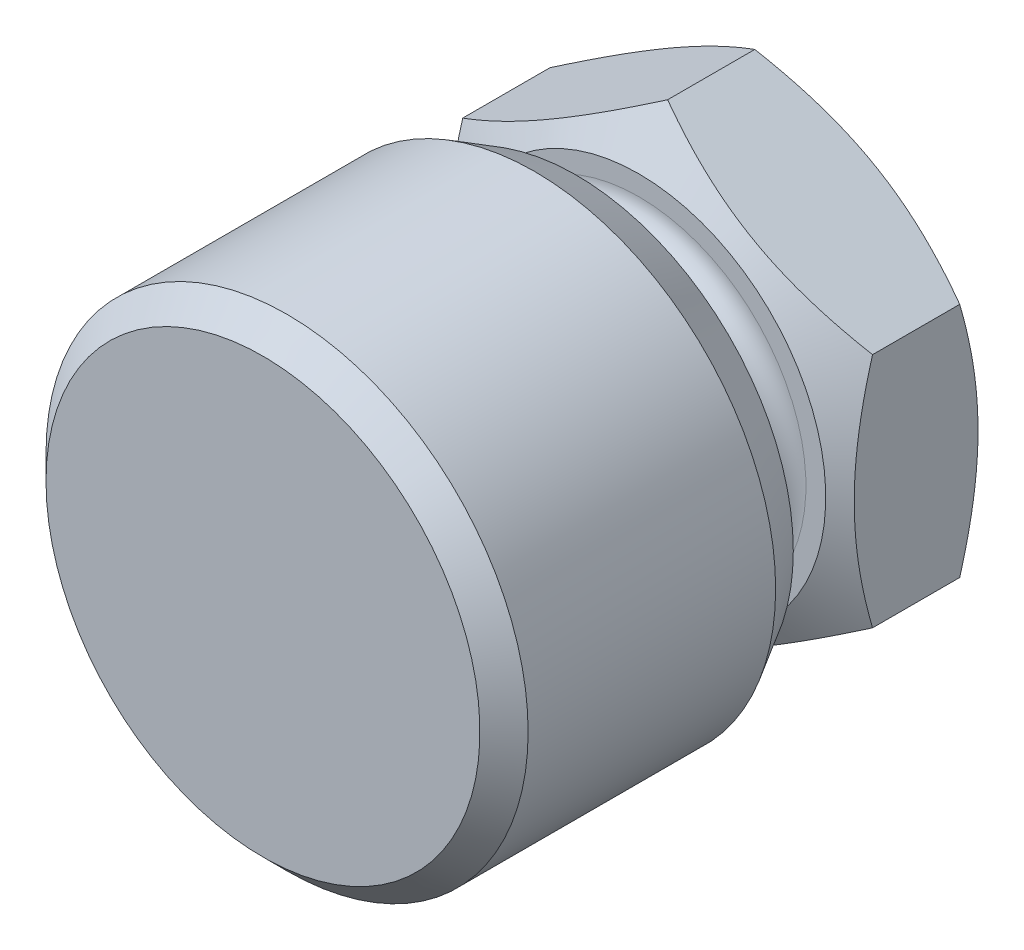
ISO-10303-21;
HEADER;
FILE_DESCRIPTION(('STEP AP214'),'2;1');
FILE_NAME('part.step','',(''),(''),'','','');
FILE_SCHEMA(('AUTOMOTIVE_DESIGN { 1 0 10303 214 1 1 1 1 }'));
ENDSEC;
DATA;
#1=APPLICATION_CONTEXT('core data for automotive mechanical design processes');
#2=APPLICATION_PROTOCOL_DEFINITION('international standard','automotive_design',2000,#1);
#3=PRODUCT_CONTEXT('',#1,'mechanical');
#4=PRODUCT('Part','Part','',(#3));
#5=PRODUCT_RELATED_PRODUCT_CATEGORY('part','',(#4));
#6=PRODUCT_DEFINITION_FORMATION('','',#4);
#7=PRODUCT_DEFINITION_CONTEXT('part definition',#1,'design');
#8=PRODUCT_DEFINITION('design','',#6,#7);
#9=PRODUCT_DEFINITION_SHAPE('','',#8);
#10=(LENGTH_UNIT() NAMED_UNIT(*) SI_UNIT(.MILLI.,.METRE.));
#11=(NAMED_UNIT(*) PLANE_ANGLE_UNIT() SI_UNIT($,.RADIAN.));
#12=(NAMED_UNIT(*) SI_UNIT($,.STERADIAN.) SOLID_ANGLE_UNIT());
#13=UNCERTAINTY_MEASURE_WITH_UNIT(LENGTH_MEASURE(1.E-05),#10,'distance_accuracy_value','');
#14=(GEOMETRIC_REPRESENTATION_CONTEXT(3) GLOBAL_UNCERTAINTY_ASSIGNED_CONTEXT((#13)) GLOBAL_UNIT_ASSIGNED_CONTEXT((#10,
#11,#12)) REPRESENTATION_CONTEXT('',''));
#15=CARTESIAN_POINT('',(0.,0.,0.));
#16=DIRECTION('',(0.,0.,1.));
#17=DIRECTION('',(1.,0.,0.));
#18=AXIS2_PLACEMENT_3D('',#15,#16,#17);
#19=CARTESIAN_POINT('',(0.,0.,21.5953521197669));
#20=DIRECTION('',(0.,0.,-1.));
#21=DIRECTION('',(-1.,0.,0.));
#22=AXIS2_PLACEMENT_3D('',#19,#20,#21);
#23=CONICAL_SURFACE('',#22,9.,0.785398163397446);
#24=CARTESIAN_POINT('',(0.,0.,20.5953521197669));
#25=DIRECTION('',(0.,0.,-1.));
#26=DIRECTION('',(-1.,0.,0.));
#27=AXIS2_PLACEMENT_3D('',#24,#25,#26);
#28=CIRCLE('',#27,10.);
#29=CARTESIAN_POINT('',(-10.,0.,20.5953521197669));
#30=VERTEX_POINT('',#29);
#31=EDGE_CURVE('E259',#30,#30,#28,.T.);
#32=ORIENTED_EDGE('',*,*,#31,.F.);
#33=EDGE_LOOP('',(#32));
#34=FACE_BOUND('',#33,.T.);
#35=CARTESIAN_POINT('',(0.,0.,21.5953521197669));
#36=DIRECTION('',(0.,0.,-1.));
#37=DIRECTION('',(-1.,0.,0.));
#38=AXIS2_PLACEMENT_3D('',#35,#36,#37);
#39=CIRCLE('',#38,9.);
#40=CARTESIAN_POINT('',(-9.,0.,21.5953521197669));
#41=VERTEX_POINT('',#40);
#42=EDGE_CURVE('E262',#41,#41,#39,.F.);
#43=ORIENTED_EDGE('',*,*,#42,.F.);
#44=EDGE_LOOP('',(#43));
#45=FACE_BOUND('',#44,.T.);
#46=ADVANCED_FACE('F14',(#34,#45),#23,.T.);
#47=CARTESIAN_POINT('',(0.,0.,21.5953521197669));
#48=DIRECTION('',(0.,0.,1.));
#49=DIRECTION('',(1.,0.,0.));
#50=AXIS2_PLACEMENT_3D('',#47,#48,#49);
#51=CYLINDRICAL_SURFACE('',#50,10.);
#52=ORIENTED_EDGE('',*,*,#31,.T.);
#53=EDGE_LOOP('',(#52));
#54=FACE_BOUND('',#53,.T.);
#55=CARTESIAN_POINT('',(0.,0.,10.3274029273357));
#56=DIRECTION('',(0.,0.,1.));
#57=DIRECTION('',(1.,0.,0.));
#58=AXIS2_PLACEMENT_3D('',#55,#56,#57);
#59=CIRCLE('',#58,10.);
#60=CARTESIAN_POINT('',(10.,0.,10.3274029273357));
#61=VERTEX_POINT('',#60);
#62=EDGE_CURVE('E269',#61,#61,#59,.T.);
#63=ORIENTED_EDGE('',*,*,#62,.T.);
#64=EDGE_LOOP('',(#63));
#65=FACE_BOUND('',#64,.T.);
#66=ADVANCED_FACE('F285',(#54,#65),#51,.T.);
#67=CARTESIAN_POINT('',(0.,0.,8.59535211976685));
#68=DIRECTION('',(0.,0.,1.));
#69=DIRECTION('',(1.,0.,0.));
#70=AXIS2_PLACEMENT_3D('',#67,#68,#69);
#71=CONICAL_SURFACE('',#70,9.,0.523598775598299);
#72=ORIENTED_EDGE('',*,*,#62,.F.);
#73=EDGE_LOOP('',(#72));
#74=FACE_BOUND('',#73,.T.);
#75=CARTESIAN_POINT('',(0.,0.,8.59535211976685));
#76=DIRECTION('',(0.,0.,1.));
#77=DIRECTION('',(1.,0.,0.));
#78=AXIS2_PLACEMENT_3D('',#75,#76,#77);
#79=CIRCLE('',#78,9.);
#80=CARTESIAN_POINT('',(9.,0.,8.59535211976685));
#81=VERTEX_POINT('',#80);
#82=EDGE_CURVE('E272',#81,#81,#79,.T.);
#83=ORIENTED_EDGE('',*,*,#82,.T.);
#84=EDGE_LOOP('',(#83));
#85=FACE_BOUND('',#84,.T.);
#86=ADVANCED_FACE('F290',(#74,#85),#71,.T.);
#87=CARTESIAN_POINT('',(-10.,0.,21.5953521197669));
#88=DIRECTION('',(0.,0.,-1.));
#89=DIRECTION('',(-1.,0.,0.));
#90=AXIS2_PLACEMENT_3D('',#87,#88,#89);
#91=PLANE('',#90);
#92=ORIENTED_EDGE('',*,*,#42,.T.);
#93=EDGE_LOOP('',(#92));
#94=FACE_BOUND('',#93,.T.);
#95=ADVANCED_FACE('F282',(#94),#91,.F.);
#96=CARTESIAN_POINT('',(-6.95,0.,8.59535211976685));
#97=DIRECTION('',(0.,0.,1.));
#98=DIRECTION('',(1.,0.,0.));
#99=AXIS2_PLACEMENT_3D('',#96,#97,#98);
#100=PLANE('',#99);
#101=ORIENTED_EDGE('',*,*,#82,.F.);
#102=EDGE_LOOP('',(#101));
#103=FACE_BOUND('',#102,.T.);
#104=CARTESIAN_POINT('',(0.,0.,8.59535211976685));
#105=DIRECTION('',(0.,0.,1.));
#106=DIRECTION('',(0.,-1.,0.));
#107=AXIS2_PLACEMENT_3D('',#104,#105,#106);
#108=CIRCLE('',#107,6.5740146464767);
#109=CARTESIAN_POINT('',(0.,-6.5740146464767,8.59535211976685));
#110=VERTEX_POINT('',#109);
#111=EDGE_CURVE('E9',#110,#110,#108,.T.);
#112=ORIENTED_EDGE('',*,*,#111,.T.);
#113=EDGE_LOOP('',(#112));
#114=FACE_BOUND('',#113,.T.);
#115=ADVANCED_FACE('F251',(#103,#114),#100,.F.);
#116=CARTESIAN_POINT('',(0.,0.,0.));
#117=DIRECTION('',(0.,0.,-1.));
#118=DIRECTION('',(0.,1.,0.));
#119=AXIS2_PLACEMENT_3D('',#116,#117,#118);
#120=CONICAL_SURFACE('',#119,5.85,0.785398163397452);
#121=CARTESIAN_POINT('',(0.,0.,0.84999999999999));
#122=DIRECTION('',(0.,0.,-1.));
#123=DIRECTION('',(0.,-1.,0.));
#124=AXIS2_PLACEMENT_3D('',#121,#122,#123);
#125=CIRCLE('',#124,5.);
#126=CARTESIAN_POINT('',(0.,-5.,0.84999999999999));
#127=VERTEX_POINT('',#126);
#128=EDGE_CURVE('E17',#127,#127,#125,.F.);
#129=ORIENTED_EDGE('',*,*,#128,.T.);
#130=EDGE_LOOP('',(#129));
#131=FACE_BOUND('',#130,.T.);
#132=CARTESIAN_POINT('',(0.,0.,0.));
#133=DIRECTION('',(0.,0.,-1.));
#134=DIRECTION('',(0.,1.,0.));
#135=AXIS2_PLACEMENT_3D('',#132,#133,#134);
#136=CIRCLE('',#135,5.85);
#137=CARTESIAN_POINT('',(0.,5.85,0.));
#138=VERTEX_POINT('',#137);
#139=EDGE_CURVE('E256',#138,#138,#136,.T.);
#140=ORIENTED_EDGE('',*,*,#139,.T.);
#141=EDGE_LOOP('',(#140));
#142=FACE_BOUND('',#141,.T.);
#143=ADVANCED_FACE('F244',(#131,#142),#120,.F.);
#144=CARTESIAN_POINT('',(0.,-9.81495457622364,0.));
#145=DIRECTION('',(0.,0.,1.));
#146=DIRECTION('',(0.,-1.,0.));
#147=AXIS2_PLACEMENT_3D('',#144,#145,#146);
#148=PLANE('',#147);
#149=ORIENTED_EDGE('',*,*,#139,.F.);
#150=EDGE_LOOP('',(#149));
#151=FACE_BOUND('',#150,.T.);
#152=CARTESIAN_POINT('',(0.,0.,0.));
#153=DIRECTION('',(0.,0.,-1.));
#154=DIRECTION('',(0.,1.,0.));
#155=AXIS2_PLACEMENT_3D('',#152,#153,#154);
#156=CIRCLE('',#155,7.75);
#157=CARTESIAN_POINT('',(0.,7.75,0.));
#158=VERTEX_POINT('',#157);
#159=EDGE_CURVE('E187',#158,#158,#156,.T.);
#160=ORIENTED_EDGE('',*,*,#159,.T.);
#161=EDGE_LOOP('',(#160));
#162=FACE_BOUND('',#161,.T.);
#163=ADVANCED_FACE('F242',(#151,#162),#148,.F.);
#164=CARTESIAN_POINT('',(0.,0.,0.));
#165=DIRECTION('',(0.,0.,1.));
#166=DIRECTION('',(0.,1.,0.));
#167=AXIS2_PLACEMENT_3D('',#164,#165,#166);
#168=CONICAL_SURFACE('',#167,7.75,1.0471975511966);
#169=ORIENTED_EDGE('',*,*,#159,.F.);
#170=EDGE_LOOP('',(#169));
#171=FACE_BOUND('',#170,.T.);
#172=CARTESIAN_POINT('',(-8.5,13.0674083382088,4.52566801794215));
#173=CARTESIAN_POINT('',(-8.5,12.6970264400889,4.34646393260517));
#174=CARTESIAN_POINT('',(-8.5,12.3257817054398,4.16901198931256));
#175=CARTESIAN_POINT('',(-8.5,11.5811070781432,3.81860050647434));
#176=CARTESIAN_POINT('',(-8.5,11.2076768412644,3.64564169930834));
#177=CARTESIAN_POINT('',(-8.5,10.4561928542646,3.30431011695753));
#178=CARTESIAN_POINT('',(-8.5,10.0781249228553,3.13596845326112));
#179=CARTESIAN_POINT('',(-8.5,9.31894068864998,2.80633194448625));
#180=CARTESIAN_POINT('',(-8.5,8.93782453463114,2.64503675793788));
#181=CARTESIAN_POINT('',(-8.5,8.16024781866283,2.32657055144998));
#182=CARTESIAN_POINT('',(-8.5,7.76367370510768,2.1696752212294));
#183=CARTESIAN_POINT('',(-8.5,6.96584516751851,1.86803908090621));
#184=CARTESIAN_POINT('',(-8.5,6.56459021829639,1.72329964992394));
#185=CARTESIAN_POINT('',(-8.5,5.75754493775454,1.44985865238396));
#186=CARTESIAN_POINT('',(-8.5,5.35176606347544,1.32112364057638));
#187=CARTESIAN_POINT('',(-8.5,4.53440542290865,1.08389490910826));
#188=CARTESIAN_POINT('',(-8.5,4.12282556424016,0.975394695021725));
#189=CARTESIAN_POINT('',(-8.5,3.2957373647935,0.784474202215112));
#190=CARTESIAN_POINT('',(-8.5,2.88026033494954,0.701921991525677));
#191=CARTESIAN_POINT('',(-8.5,2.25335567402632,0.601204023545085));
#192=CARTESIAN_POINT('',(-8.5,2.0437567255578,0.57148172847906));
#193=CARTESIAN_POINT('',(-8.5,1.62355650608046,0.520325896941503));
#194=CARTESIAN_POINT('',(-8.5,1.41295533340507,0.498891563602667));
#195=CARTESIAN_POINT('',(-8.5,0.993735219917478,0.465001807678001));
#196=CARTESIAN_POINT('',(-8.5,0.78512529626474,0.45243525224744));
#197=CARTESIAN_POINT('',(-8.5,0.367561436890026,0.436126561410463));
#198=CARTESIAN_POINT('',(-8.5,0.158607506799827,0.43238428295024));
#199=CARTESIAN_POINT('',(-8.5,-0.259274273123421,0.433813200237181));
#200=CARTESIAN_POINT('',(-8.5,-0.468202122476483,0.438984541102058));
#201=CARTESIAN_POINT('',(-8.5,-0.885657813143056,0.458116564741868));
#202=CARTESIAN_POINT('',(-8.5,-1.09418563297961,0.472077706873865));
#203=CARTESIAN_POINT('',(-8.5,-1.59874294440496,0.516201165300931));
#204=CARTESIAN_POINT('',(-8.5,-1.89439892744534,0.550722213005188));
#205=CARTESIAN_POINT('',(-8.5,-2.48342769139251,0.635524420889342));
#206=CARTESIAN_POINT('',(-8.5,-2.77680014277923,0.68580781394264));
#207=CARTESIAN_POINT('',(-8.5,-3.65319685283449,0.857627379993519));
#208=CARTESIAN_POINT('',(-8.5,-4.2321658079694,1.00009989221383));
#209=CARTESIAN_POINT('',(-8.5,-5.09799333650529,1.24609692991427));
#210=CARTESIAN_POINT('',(-8.5,-5.38936478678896,1.33464080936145));
#211=CARTESIAN_POINT('',(-8.5,-5.96927459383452,1.52064802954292));
#212=CARTESIAN_POINT('',(-8.5,-6.2578129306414,1.61811143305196));
#213=CARTESIAN_POINT('',(-8.5,-6.83215576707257,1.82041649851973));
#214=CARTESIAN_POINT('',(-8.5,-7.1179611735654,1.92525560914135));
#215=CARTESIAN_POINT('',(-8.5,-7.68721940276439,2.14110586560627));
#216=CARTESIAN_POINT('',(-8.5,-7.97067226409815,2.25211690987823));
#217=CARTESIAN_POINT('',(-8.5,-8.68625208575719,2.53990591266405));
#218=CARTESIAN_POINT('',(-8.5,-9.11697898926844,2.72016036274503));
#219=CARTESIAN_POINT('',(-8.5,-9.97446570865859,3.08989937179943));
#220=CARTESIAN_POINT('',(-8.5,-10.4012252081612,3.27938465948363));
#221=CARTESIAN_POINT('',(-8.5,-11.2516092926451,3.66555544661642));
#222=CARTESIAN_POINT('',(-8.5,-11.6752329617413,3.8622429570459));
#223=CARTESIAN_POINT('',(-8.5,-12.5198099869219,4.26122375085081));
#224=CARTESIAN_POINT('',(-8.5,-12.9407634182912,4.46351687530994));
#225=CARTESIAN_POINT('',(-8.5,-13.7810262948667,4.87283077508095));
#226=CARTESIAN_POINT('',(-8.5,-14.2003329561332,5.07985725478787));
#227=CARTESIAN_POINT('',(-8.5,-15.0371442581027,5.49752124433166));
#228=CARTESIAN_POINT('',(-8.5,-15.454648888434,5.70815877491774));
#229=CARTESIAN_POINT('',(-8.5,-16.2880900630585,6.13234427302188));
#230=CARTESIAN_POINT('',(-8.5,-16.704026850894,6.3458917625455));
#231=CARTESIAN_POINT('',(-8.5,-17.5346431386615,6.77541937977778));
#232=CARTESIAN_POINT('',(-8.5,-17.9493226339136,6.99139951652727));
#233=CARTESIAN_POINT('',(-8.5,-19.1138362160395,7.60153093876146));
#234=CARTESIAN_POINT('',(-8.5,-19.8624637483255,7.9979848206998));
#235=CARTESIAN_POINT('',(-8.5,-21.3571542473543,8.79576721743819));
#236=CARTESIAN_POINT('',(-8.5,-22.1032170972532,9.19709595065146));
#237=CARTESIAN_POINT('',(-8.5,-23.591297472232,10.002323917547));
#238=CARTESIAN_POINT('',(-8.5,-24.3333204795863,10.4062130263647));
#239=CARTESIAN_POINT('',(-8.5,-25.4451681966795,11.014160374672));
#240=CARTESIAN_POINT('',(-8.5,-25.815574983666,11.2171555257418));
#241=CARTESIAN_POINT('',(-8.5,-26.5560406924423,11.6237780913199));
#242=CARTESIAN_POINT('',(-8.5,-26.9260996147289,11.8274055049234));
#243=CARTESIAN_POINT('',(-8.5,-27.2960051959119,12.0313111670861));
#244=B_SPLINE_CURVE_WITH_KNOTS('',3,(#172,#173,#174,#175,#176,#177,#178,#179,#180,#181,#182,
#183,#184,#185,#186,#187,#188,#189,#190,#191,#192,#193,#194,#195,#196,#197,#198,#199,#200,#201,
#202,#203,#204,#205,#206,#207,#208,#209,#210,#211,#212,#213,#214,#215,#216,#217,#218,#219,#220,
#221,#222,#223,#224,#225,#226,#227,#228,#229,#230,#231,#232,#233,#234,#235,#236,#237,#238,#239,
#240,#241,#242,#243),.UNSPECIFIED.,.F.,.F.,(4,2,2,2,2,2,2,2,2,2,2,2,2,2,2,2,2,2,2,2,2,2,2,2,2,2,
2,2,2,2,2,2,2,2,2,4),(0.,1.23438662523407,2.46897320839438,3.71047455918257,4.95191568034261,
6.2312081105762,7.51064548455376,8.78736252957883,10.063669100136,11.3333772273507,
11.9683266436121,12.6032149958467,13.2299982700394,13.8567713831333,14.4835547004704,
15.1103707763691,16.002858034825,16.8954717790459,18.6817036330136,19.5952151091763,
20.5087330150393,21.421936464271,22.3351248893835,23.7357409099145,25.1364676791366,
26.5375885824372,27.9386698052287,29.3415392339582,30.7444167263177,32.1470664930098,
33.5497214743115,36.0910654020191,38.6325236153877,41.1669816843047,42.4341331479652,
43.7012827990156),.UNSPECIFIED.);
#245=CARTESIAN_POINT('',(-8.5,-4.90747728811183,1.19220208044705));
#246=VERTEX_POINT('',#245);
#247=CARTESIAN_POINT('',(-8.5,4.90747728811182,1.19220208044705));
#248=VERTEX_POINT('',#247);
#249=EDGE_CURVE('E67',#246,#248,#244,.F.);
#250=ORIENTED_EDGE('',*,*,#249,.T.);
#251=CARTESIAN_POINT('',(-8.5002,4.90736181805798,1.1922687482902));
#252=CARTESIAN_POINT('',(-8.31336077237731,5.01523349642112,1.12999884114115));
#253=CARTESIAN_POINT('',(-8.12582494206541,5.1235073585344,1.07055499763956));
#254=CARTESIAN_POINT('',(-7.74923024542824,5.34093440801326,0.958097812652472));
#255=CARTESIAN_POINT('',(-7.56017075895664,5.45008795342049,0.905087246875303));
#256=CARTESIAN_POINT('',(-6.9899652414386,5.77929626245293,0.756746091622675));
#257=CARTESIAN_POINT('',(-6.60656835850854,6.00065055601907,0.672371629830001));
#258=CARTESIAN_POINT('',(-6.03282233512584,6.33190297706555,0.573432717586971));
#259=CARTESIAN_POINT('',(-5.84418723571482,6.44081150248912,0.545247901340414));
#260=CARTESIAN_POINT('',(-5.46606397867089,6.65912106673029,0.497986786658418));
#261=CARTESIAN_POINT('',(-5.27657589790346,6.76852206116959,0.478909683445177));
#262=CARTESIAN_POINT('',(-4.8972734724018,6.98751241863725,0.450347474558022));
#263=CARTESIAN_POINT('',(-4.70745974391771,7.09710142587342,0.440851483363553));
#264=CARTESIAN_POINT('',(-4.32765694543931,7.3163806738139,0.431655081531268));
#265=CARTESIAN_POINT('',(-4.13766788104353,7.42607091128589,0.431954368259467));
#266=CARTESIAN_POINT('',(-3.78247698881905,7.63114046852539,0.441667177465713));
#267=CARTESIAN_POINT('',(-3.6172500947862,7.72653426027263,0.449895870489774));
#268=CARTESIAN_POINT('',(-3.28718328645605,7.9170984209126,0.473601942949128));
#269=CARTESIAN_POINT('',(-3.12234339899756,8.01226877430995,0.489079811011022));
#270=CARTESIAN_POINT('',(-2.62846189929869,8.29741139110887,0.546021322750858));
#271=CARTESIAN_POINT('',(-2.30029449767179,8.48687892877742,0.597985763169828));
#272=CARTESIAN_POINT('',(-1.64047857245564,8.86782383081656,0.727897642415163));
#273=CARTESIAN_POINT('',(-1.30891425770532,9.05925257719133,0.806395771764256));
#274=CARTESIAN_POINT('',(-0.650730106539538,9.43925537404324,0.984554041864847));
#275=CARTESIAN_POINT('',(-0.324101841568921,9.62783429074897,1.0841723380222));
#276=CARTESIAN_POINT('',(0.000199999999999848,9.81507004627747,1.1922687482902));
#277=B_SPLINE_CURVE_WITH_KNOTS('',3,(#251,#252,#253,#254,#255,#256,#257,#258,#259,#260,#261,
#262,#263,#264,#265,#266,#267,#268,#269,#270,#271,#272,#273,#274,#275,#276),.UNSPECIFIED.,.F.,
.F.,(4,2,2,2,2,2,2,2,2,2,2,2,4),(0.,0.673596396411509,1.34748239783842,2.69805431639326,
3.356799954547,4.01548737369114,4.67342558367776,5.33134346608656,5.9040955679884,
6.47688628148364,7.62328361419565,8.79510569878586,9.96462743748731),.UNSPECIFIED.);
#278=CARTESIAN_POINT('',(0.,9.81495457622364,1.19220208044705));
#279=VERTEX_POINT('',#278);
#280=EDGE_CURVE('E83',#248,#279,#277,.T.);
#281=ORIENTED_EDGE('',*,*,#280,.T.);
#282=CARTESIAN_POINT('',(-0.00019999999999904,9.81507004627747,1.1922687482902));
#283=CARTESIAN_POINT('',(0.186639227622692,9.70719836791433,1.12999884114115));
#284=CARTESIAN_POINT('',(0.374175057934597,9.59892450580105,1.07055499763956));
#285=CARTESIAN_POINT('',(0.750769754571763,9.3814974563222,0.95809781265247));
#286=CARTESIAN_POINT('',(0.939829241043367,9.27234391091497,0.905087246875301));
#287=CARTESIAN_POINT('',(1.5100347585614,8.94313560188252,0.756746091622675));
#288=CARTESIAN_POINT('',(1.89343164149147,8.72178130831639,0.672371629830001));
#289=CARTESIAN_POINT('',(2.46717766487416,8.39052888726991,0.57343271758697));
#290=CARTESIAN_POINT('',(2.65581276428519,8.28162036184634,0.545247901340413));
#291=CARTESIAN_POINT('',(3.03393602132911,8.06331079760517,0.497986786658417));
#292=CARTESIAN_POINT('',(3.22342410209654,7.95390980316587,0.478909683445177));
#293=CARTESIAN_POINT('',(3.6027265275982,7.73491944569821,0.450347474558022));
#294=CARTESIAN_POINT('',(3.79254025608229,7.62533043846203,0.440851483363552));
#295=CARTESIAN_POINT('',(4.17234305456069,7.40605119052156,0.431655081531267));
#296=CARTESIAN_POINT('',(4.36233211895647,7.29636095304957,0.431954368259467));
#297=CARTESIAN_POINT('',(4.71752301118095,7.09129139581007,0.441667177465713));
#298=CARTESIAN_POINT('',(4.8827499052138,6.99589760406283,0.449895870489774));
#299=CARTESIAN_POINT('',(5.21281671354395,6.80533344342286,0.473601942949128));
#300=CARTESIAN_POINT('',(5.37765660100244,6.71016309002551,0.489079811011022));
#301=CARTESIAN_POINT('',(5.87153810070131,6.42502047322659,0.546021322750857));
#302=CARTESIAN_POINT('',(6.19970550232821,6.23555293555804,0.597985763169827));
#303=CARTESIAN_POINT('',(6.85952142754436,5.8546080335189,0.727897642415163));
#304=CARTESIAN_POINT('',(7.19108574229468,5.66317928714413,0.806395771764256));
#305=CARTESIAN_POINT('',(7.84926989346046,5.28317649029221,0.984554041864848));
#306=CARTESIAN_POINT('',(8.17589815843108,5.09459757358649,1.0841723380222));
#307=CARTESIAN_POINT('',(8.5002,4.90736181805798,1.1922687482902));
#308=B_SPLINE_CURVE_WITH_KNOTS('',3,(#282,#283,#284,#285,#286,#287,#288,#289,#290,#291,#292,
#293,#294,#295,#296,#297,#298,#299,#300,#301,#302,#303,#304,#305,#306,#307),.UNSPECIFIED.,.F.,
.F.,(4,2,2,2,2,2,2,2,2,2,2,2,4),(0.,0.673596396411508,1.34748239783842,2.69805431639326,
3.356799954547,4.01548737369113,4.67342558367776,5.33134346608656,5.9040955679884,
6.47688628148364,7.62328361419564,8.79510569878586,9.96462743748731),.UNSPECIFIED.);
#309=CARTESIAN_POINT('',(8.5,4.90747728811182,1.19220208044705));
#310=VERTEX_POINT('',#309);
#311=EDGE_CURVE('E194',#279,#310,#308,.T.);
#312=ORIENTED_EDGE('',*,*,#311,.T.);
#313=CARTESIAN_POINT('',(8.5,13.0674083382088,4.5256680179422));
#314=CARTESIAN_POINT('',(8.5,12.6970264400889,4.34646393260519));
#315=CARTESIAN_POINT('',(8.5,12.3257817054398,4.16901198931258));
#316=CARTESIAN_POINT('',(8.5,11.5811070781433,3.81860050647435));
#317=CARTESIAN_POINT('',(8.5,11.2076768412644,3.64564169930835));
#318=CARTESIAN_POINT('',(8.5,10.4561928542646,3.30431011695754));
#319=CARTESIAN_POINT('',(8.5,10.0781249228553,3.13596845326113));
#320=CARTESIAN_POINT('',(8.5,9.31894068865,2.80633194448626));
#321=CARTESIAN_POINT('',(8.5,8.93782453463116,2.64503675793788));
#322=CARTESIAN_POINT('',(8.5,8.16024781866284,2.32657055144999));
#323=CARTESIAN_POINT('',(8.5,7.7636737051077,2.1696752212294));
#324=CARTESIAN_POINT('',(8.5,6.96584516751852,1.86803908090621));
#325=CARTESIAN_POINT('',(8.5,6.5645902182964,1.72329964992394));
#326=CARTESIAN_POINT('',(8.5,5.75754493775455,1.44985865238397));
#327=CARTESIAN_POINT('',(8.5,5.35176606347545,1.32112364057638));
#328=CARTESIAN_POINT('',(8.5,4.53440542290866,1.08389490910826));
#329=CARTESIAN_POINT('',(8.5,4.12282556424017,0.975394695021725));
#330=CARTESIAN_POINT('',(8.5,3.29573736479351,0.784474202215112));
#331=CARTESIAN_POINT('',(8.5,2.88026033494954,0.701921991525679));
#332=CARTESIAN_POINT('',(8.5,2.25335567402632,0.601204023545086));
#333=CARTESIAN_POINT('',(8.5,2.0437567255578,0.571481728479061));
#334=CARTESIAN_POINT('',(8.5,1.62355650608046,0.520325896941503));
#335=CARTESIAN_POINT('',(8.5,1.41295533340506,0.498891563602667));
#336=CARTESIAN_POINT('',(8.5,0.993735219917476,0.465001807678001));
#337=CARTESIAN_POINT('',(8.5,0.785125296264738,0.45243525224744));
#338=CARTESIAN_POINT('',(8.5,0.367561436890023,0.436126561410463));
#339=CARTESIAN_POINT('',(8.5,0.158607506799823,0.43238428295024));
#340=CARTESIAN_POINT('',(8.5,-0.259274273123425,0.433813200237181));
#341=CARTESIAN_POINT('',(8.5,-0.468202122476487,0.438984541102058));
#342=CARTESIAN_POINT('',(8.5,-0.885657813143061,0.458116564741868));
#343=CARTESIAN_POINT('',(8.5,-1.09418563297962,0.472077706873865));
#344=CARTESIAN_POINT('',(8.5,-1.59874294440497,0.516201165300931));
#345=CARTESIAN_POINT('',(8.5,-1.89439892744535,0.550722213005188));
#346=CARTESIAN_POINT('',(8.5,-2.48342769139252,0.635524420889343));
#347=CARTESIAN_POINT('',(8.5,-2.77680014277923,0.685807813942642));
#348=CARTESIAN_POINT('',(8.5,-3.6531968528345,0.857627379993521));
#349=CARTESIAN_POINT('',(8.5,-4.23216580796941,1.00009989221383));
#350=CARTESIAN_POINT('',(8.5,-5.09799333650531,1.24609692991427));
#351=CARTESIAN_POINT('',(8.5,-5.38936478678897,1.33464080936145));
#352=CARTESIAN_POINT('',(8.5,-5.96927459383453,1.52064802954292));
#353=CARTESIAN_POINT('',(8.5,-6.25781293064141,1.61811143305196));
#354=CARTESIAN_POINT('',(8.5,-6.83215576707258,1.82041649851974));
#355=CARTESIAN_POINT('',(8.5,-7.1179611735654,1.92525560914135));
#356=CARTESIAN_POINT('',(8.5,-7.6872194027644,2.14110586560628));
#357=CARTESIAN_POINT('',(8.5,-7.97067226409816,2.25211690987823));
#358=CARTESIAN_POINT('',(8.5,-8.6862520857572,2.53990591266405));
#359=CARTESIAN_POINT('',(8.5,-9.11697898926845,2.72016036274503));
#360=CARTESIAN_POINT('',(8.5,-9.9744657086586,3.08989937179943));
#361=CARTESIAN_POINT('',(8.5,-10.4012252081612,3.27938465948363));
#362=CARTESIAN_POINT('',(8.5,-11.2516092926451,3.66555544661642));
#363=CARTESIAN_POINT('',(8.5,-11.6752329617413,3.8622429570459));
#364=CARTESIAN_POINT('',(8.5,-12.5198099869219,4.26122375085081));
#365=CARTESIAN_POINT('',(8.5,-12.9407634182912,4.46351687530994));
#366=CARTESIAN_POINT('',(8.5,-13.7810262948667,4.87283077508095));
#367=CARTESIAN_POINT('',(8.5,-14.2003329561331,5.07985725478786));
#368=CARTESIAN_POINT('',(8.5,-15.0371442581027,5.49752124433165));
#369=CARTESIAN_POINT('',(8.5,-15.454648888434,5.70815877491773));
#370=CARTESIAN_POINT('',(8.5,-16.2880900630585,6.13234427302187));
#371=CARTESIAN_POINT('',(8.5,-16.704026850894,6.34589176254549));
#372=CARTESIAN_POINT('',(8.5,-17.5346431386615,6.77541937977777));
#373=CARTESIAN_POINT('',(8.5,-17.9493226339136,6.99139951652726));
#374=CARTESIAN_POINT('',(8.5,-19.1138362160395,7.60153093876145));
#375=CARTESIAN_POINT('',(8.5,-19.8624637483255,7.99798482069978));
#376=CARTESIAN_POINT('',(8.5,-21.3571542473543,8.79576721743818));
#377=CARTESIAN_POINT('',(8.5,-22.1032170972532,9.19709595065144));
#378=CARTESIAN_POINT('',(8.5,-23.5912974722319,10.002323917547));
#379=CARTESIAN_POINT('',(8.5,-24.3333204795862,10.4062130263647));
#380=CARTESIAN_POINT('',(8.5,-25.4451681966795,11.014160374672));
#381=CARTESIAN_POINT('',(8.5,-25.815574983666,11.2171555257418));
#382=CARTESIAN_POINT('',(8.5,-26.5560406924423,11.6237780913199));
#383=CARTESIAN_POINT('',(8.5,-26.9260996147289,11.8274055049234));
#384=CARTESIAN_POINT('',(8.5,-27.2960051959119,12.0313111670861));
#385=B_SPLINE_CURVE_WITH_KNOTS('',3,(#313,#314,#315,#316,#317,#318,#319,#320,#321,#322,#323,
#324,#325,#326,#327,#328,#329,#330,#331,#332,#333,#334,#335,#336,#337,#338,#339,#340,#341,#342,
#343,#344,#345,#346,#347,#348,#349,#350,#351,#352,#353,#354,#355,#356,#357,#358,#359,#360,#361,
#362,#363,#364,#365,#366,#367,#368,#369,#370,#371,#372,#373,#374,#375,#376,#377,#378,#379,#380,
#381,#382,#383,#384),.UNSPECIFIED.,.F.,.F.,(4,2,2,2,2,2,2,2,2,2,2,2,2,2,2,2,2,2,2,2,2,2,2,2,2,2,
2,2,2,2,2,2,2,2,2,4),(0.,1.23438662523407,2.46897320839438,3.71047455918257,4.95191568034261,
6.23120811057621,7.51064548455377,8.78736252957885,10.063669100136,11.3333772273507,
11.9683266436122,12.6032149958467,13.2299982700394,13.8567713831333,14.4835547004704,
15.1103707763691,16.002858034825,16.8954717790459,18.6817036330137,19.5952151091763,
20.5087330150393,21.421936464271,22.3351248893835,23.7357409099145,25.1364676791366,
26.5375885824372,27.9386698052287,29.3415392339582,30.7444167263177,32.1470664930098,
33.5497214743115,36.0910654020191,38.6325236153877,41.1669816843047,42.4341331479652,
43.7012827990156),.UNSPECIFIED.);
#386=CARTESIAN_POINT('',(8.5,-4.90747728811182,1.19220208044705));
#387=VERTEX_POINT('',#386);
#388=EDGE_CURVE('E186',#310,#387,#385,.T.);
#389=ORIENTED_EDGE('',*,*,#388,.T.);
#390=CARTESIAN_POINT('',(8.5002,-4.90736181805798,1.1922687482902));
#391=CARTESIAN_POINT('',(8.31336077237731,-5.01523349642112,1.12999884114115));
#392=CARTESIAN_POINT('',(8.12582494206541,-5.1235073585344,1.07055499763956));
#393=CARTESIAN_POINT('',(7.74923024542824,-5.34093440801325,0.95809781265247));
#394=CARTESIAN_POINT('',(7.56017075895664,-5.45008795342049,0.905087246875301));
#395=CARTESIAN_POINT('',(6.9899652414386,-5.77929626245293,0.756746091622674));
#396=CARTESIAN_POINT('',(6.60656835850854,-6.00065055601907,0.67237162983));
#397=CARTESIAN_POINT('',(6.03282233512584,-6.33190297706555,0.573432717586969));
#398=CARTESIAN_POINT('',(5.84418723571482,-6.44081150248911,0.545247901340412));
#399=CARTESIAN_POINT('',(5.46606397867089,-6.65912106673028,0.497986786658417));
#400=CARTESIAN_POINT('',(5.27657589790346,-6.76852206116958,0.478909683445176));
#401=CARTESIAN_POINT('',(4.8972734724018,-6.98751241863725,0.450347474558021));
#402=CARTESIAN_POINT('',(4.70745974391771,-7.09710142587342,0.440851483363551));
#403=CARTESIAN_POINT('',(4.32765694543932,-7.3163806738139,0.431655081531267));
#404=CARTESIAN_POINT('',(4.13766788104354,-7.42607091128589,0.431954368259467));
#405=CARTESIAN_POINT('',(3.78247698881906,-7.63114046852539,0.441667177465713));
#406=CARTESIAN_POINT('',(3.6172500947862,-7.72653426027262,0.449895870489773));
#407=CARTESIAN_POINT('',(3.28718328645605,-7.9170984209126,0.473601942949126));
#408=CARTESIAN_POINT('',(3.12234339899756,-8.01226877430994,0.489079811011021));
#409=CARTESIAN_POINT('',(2.62846189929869,-8.29741139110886,0.546021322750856));
#410=CARTESIAN_POINT('',(2.30029449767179,-8.48687892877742,0.597985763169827));
#411=CARTESIAN_POINT('',(1.64047857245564,-8.86782383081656,0.727897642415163));
#412=CARTESIAN_POINT('',(1.30891425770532,-9.05925257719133,0.806395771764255));
#413=CARTESIAN_POINT('',(0.650730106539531,-9.43925537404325,0.984554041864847));
#414=CARTESIAN_POINT('',(0.324101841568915,-9.62783429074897,1.0841723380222));
#415=CARTESIAN_POINT('',(-0.000200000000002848,-9.81507004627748,1.1922687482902));
#416=B_SPLINE_CURVE_WITH_KNOTS('',3,(#390,#391,#392,#393,#394,#395,#396,#397,#398,#399,#400,
#401,#402,#403,#404,#405,#406,#407,#408,#409,#410,#411,#412,#413,#414,#415),.UNSPECIFIED.,.F.,
.F.,(4,2,2,2,2,2,2,2,2,2,2,2,4),(0.,0.673596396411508,1.34748239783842,2.69805431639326,
3.356799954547,4.01548737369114,4.67342558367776,5.33134346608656,5.9040955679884,
6.47688628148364,7.62328361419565,8.79510569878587,9.96462743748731),.UNSPECIFIED.);
#417=CARTESIAN_POINT('',(0.,-9.81495457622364,1.19220208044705));
#418=VERTEX_POINT('',#417);
#419=EDGE_CURVE('E30',#387,#418,#416,.T.);
#420=ORIENTED_EDGE('',*,*,#419,.T.);
#421=CARTESIAN_POINT('',(0.000199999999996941,-9.81507004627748,1.1922687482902));
#422=CARTESIAN_POINT('',(-0.186639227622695,-9.70719836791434,1.12999884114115));
#423=CARTESIAN_POINT('',(-0.374175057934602,-9.59892450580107,1.07055499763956));
#424=CARTESIAN_POINT('',(-0.750769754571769,-9.38149745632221,0.958097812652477));
#425=CARTESIAN_POINT('',(-0.939829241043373,-9.27234391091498,0.905087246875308));
#426=CARTESIAN_POINT('',(-1.5100347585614,-8.94313560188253,0.756746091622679));
#427=CARTESIAN_POINT('',(-1.89343164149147,-8.7217813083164,0.672371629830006));
#428=CARTESIAN_POINT('',(-2.46717766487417,-8.39052888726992,0.573432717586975));
#429=CARTESIAN_POINT('',(-2.65581276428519,-8.28162036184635,0.545247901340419));
#430=CARTESIAN_POINT('',(-3.03393602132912,-8.06331079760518,0.497986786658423));
#431=CARTESIAN_POINT('',(-3.22342410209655,-7.95390980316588,0.478909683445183));
#432=CARTESIAN_POINT('',(-3.60272652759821,-7.73491944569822,0.450347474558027));
#433=CARTESIAN_POINT('',(-3.7925402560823,-7.62533043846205,0.440851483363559));
#434=CARTESIAN_POINT('',(-4.17234305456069,-7.40605119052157,0.431655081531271));
#435=CARTESIAN_POINT('',(-4.36233211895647,-7.29636095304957,0.431954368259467));
#436=CARTESIAN_POINT('',(-4.71752301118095,-7.09129139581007,0.441667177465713));
#437=CARTESIAN_POINT('',(-4.8827499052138,-6.99589760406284,0.449895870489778));
#438=CARTESIAN_POINT('',(-5.21281671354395,-6.80533344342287,0.473601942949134));
#439=CARTESIAN_POINT('',(-5.37765660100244,-6.71016309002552,0.489079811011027));
#440=CARTESIAN_POINT('',(-5.87153810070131,-6.4250204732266,0.546021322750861));
#441=CARTESIAN_POINT('',(-6.19970550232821,-6.23555293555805,0.597985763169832));
#442=CARTESIAN_POINT('',(-6.85952142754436,-5.85460803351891,0.727897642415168));
#443=CARTESIAN_POINT('',(-7.19108574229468,-5.66317928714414,0.806395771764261));
#444=CARTESIAN_POINT('',(-7.84926989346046,-5.28317649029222,0.98455404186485));
#445=CARTESIAN_POINT('',(-8.17589815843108,-5.0945975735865,1.0841723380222));
#446=CARTESIAN_POINT('',(-8.5002,-4.90736181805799,1.1922687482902));
#447=B_SPLINE_CURVE_WITH_KNOTS('',3,(#421,#422,#423,#424,#425,#426,#427,#428,#429,#430,#431,
#432,#433,#434,#435,#436,#437,#438,#439,#440,#441,#442,#443,#444,#445,#446),.UNSPECIFIED.,.F.,
.F.,(4,2,2,2,2,2,2,2,2,2,2,2,4),(0.,0.673596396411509,1.34748239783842,2.69805431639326,
3.356799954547,4.01548737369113,4.67342558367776,5.33134346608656,5.90409556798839,
6.47688628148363,7.62328361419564,8.79510569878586,9.9646274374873),.UNSPECIFIED.);
#448=EDGE_CURVE('E22',#418,#246,#447,.T.);
#449=ORIENTED_EDGE('',*,*,#448,.T.);
#450=EDGE_LOOP('',(#250,#281,#312,#389,#420,#449));
#451=FACE_BOUND('',#450,.T.);
#452=ADVANCED_FACE('F66',(#171,#451),#168,.T.);
#453=CARTESIAN_POINT('',(0.,0.,11.));
#454=DIRECTION('',(0.,0.,-1.));
#455=DIRECTION('',(0.,-1.,0.));
#456=AXIS2_PLACEMENT_3D('',#453,#454,#455);
#457=SPHERICAL_SURFACE('',#456,7.);
#458=CARTESIAN_POINT('',(0.,0.,7.5));
#459=DIRECTION('',(0.,0.,1.));
#460=DIRECTION('',(0.,-1.,0.));
#461=AXIS2_PLACEMENT_3D('',#458,#459,#460);
#462=CIRCLE('',#461,6.06217782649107);
#463=CARTESIAN_POINT('',(0.,-6.06217782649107,7.5));
#464=VERTEX_POINT('',#463);
#465=EDGE_CURVE('E114',#464,#464,#462,.T.);
#466=CARTESIAN_POINT('',(0.,-6.06217782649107,7.5));
#467=CARTESIAN_POINT('',(0.,-6.06848275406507,7.51092045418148));
#468=CARTESIAN_POINT('',(0.,-6.07475817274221,7.52185794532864));
#469=CARTESIAN_POINT('',(0.,-6.08724981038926,7.5437666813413));
#470=CARTESIAN_POINT('',(0.,-6.09346602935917,7.55473792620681));
#471=CARTESIAN_POINT('',(0.,-6.10583908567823,7.57671384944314));
#472=CARTESIAN_POINT('',(0.,-6.11199592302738,7.58771852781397));
#473=CARTESIAN_POINT('',(0.,-6.12425003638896,7.60976099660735));
#474=CARTESIAN_POINT('',(0.,-6.13034731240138,7.6207987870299));
#475=CARTESIAN_POINT('',(0.,-6.1424821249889,7.64290715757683));
#476=CARTESIAN_POINT('',(0.,-6.14851966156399,7.65397773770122));
#477=CARTESIAN_POINT('',(0.,-6.16053481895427,7.67615136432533));
#478=CARTESIAN_POINT('',(0.,-6.16651243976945,7.68725441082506));
#479=CARTESIAN_POINT('',(0.,-6.17840759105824,7.70949264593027));
#480=CARTESIAN_POINT('',(0.,-6.18432512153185,7.72062783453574));
#481=CARTESIAN_POINT('',(0.,-6.19609991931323,7.74293002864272));
#482=CARTESIAN_POINT('',(0.,-6.201957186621,7.75409703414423));
#483=CARTESIAN_POINT('',(0.,-6.21361128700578,7.77646253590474));
#484=CARTESIAN_POINT('',(0.,-6.2194081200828,7.78766103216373));
#485=CARTESIAN_POINT('',(0.,-6.23094118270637,7.81008918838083));
#486=CARTESIAN_POINT('',(0.,-6.23667741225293,7.82131884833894));
#487=CARTESIAN_POINT('',(0.,-6.24808910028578,7.84380900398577));
#488=CARTESIAN_POINT('',(0.,-6.25376455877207,7.8550694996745));
#489=CARTESIAN_POINT('',(0.,-6.26505453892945,7.8776209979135));
#490=CARTESIAN_POINT('',(0.,-6.27066906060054,7.88891200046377));
#491=CARTESIAN_POINT('',(0.,-6.28183700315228,7.91152418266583));
#492=CARTESIAN_POINT('',(0.,-6.28739042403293,7.92284536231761));
#493=CARTESIAN_POINT('',(0.,-6.29843600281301,7.94551756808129));
#494=CARTESIAN_POINT('',(0.,-6.30392816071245,7.95686859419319));
#495=CARTESIAN_POINT('',(0.,-6.31485105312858,7.97960016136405));
#496=CARTESIAN_POINT('',(0.,-6.32028178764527,7.99098070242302));
#497=CARTESIAN_POINT('',(0.,-6.33108167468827,8.01377096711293));
#498=CARTESIAN_POINT('',(0.,-6.33645082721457,8.02518069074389));
#499=CARTESIAN_POINT('',(0.,-6.34712739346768,8.04802898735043));
#500=CARTESIAN_POINT('',(0.,-6.3524348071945,8.05946756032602));
#501=CARTESIAN_POINT('',(0.,-6.36298774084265,8.08237322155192));
#502=CARTESIAN_POINT('',(0.,-6.36823326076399,8.09384030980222));
#503=CARTESIAN_POINT('',(0.,-6.37866225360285,8.11680266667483));
#504=CARTESIAN_POINT('',(0.,-6.38384572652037,8.12829793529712));
#505=CARTESIAN_POINT('',(0.,-6.39415047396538,8.15131631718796));
#506=CARTESIAN_POINT('',(0.,-6.39927174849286,8.16283943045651));
#507=CARTESIAN_POINT('',(0.,-6.40945194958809,8.18591316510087));
#508=CARTESIAN_POINT('',(0.,-6.41451087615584,8.19746378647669));
#509=CARTESIAN_POINT('',(0.,-6.42456623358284,8.22059219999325));
#510=CARTESIAN_POINT('',(0.,-6.42956266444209,8.23216999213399));
#511=CARTESIAN_POINT('',(0.,-6.43949288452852,8.25535240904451));
#512=CARTESIAN_POINT('',(0.,-6.4444266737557,8.26695703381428));
#513=CARTESIAN_POINT('',(0.,-6.45423146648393,8.29019277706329));
#514=CARTESIAN_POINT('',(0.,-6.45910246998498,8.30182389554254));
#515=CARTESIAN_POINT('',(0.,-6.46878154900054,8.32511228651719));
#516=CARTESIAN_POINT('',(0.,-6.47358962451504,8.33676955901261));
#517=CARTESIAN_POINT('',(0.,-6.48314270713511,8.36010991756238));
#518=CARTESIAN_POINT('',(0.,-6.48788771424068,8.37179300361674));
#519=CARTESIAN_POINT('',(0.,-6.49731452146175,8.39518464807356));
#520=CARTESIAN_POINT('',(0.,-6.50199632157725,8.40689320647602));
#521=CARTESIAN_POINT('',(0.,-6.51129657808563,8.43033545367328));
#522=CARTESIAN_POINT('',(0.,-6.5159150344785,8.44206914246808));
#523=CARTESIAN_POINT('',(0.,-6.52508846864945,8.4655613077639));
#524=CARTESIAN_POINT('',(0.,-6.52964344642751,8.47731978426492));
#525=CARTESIAN_POINT('',(0.,-6.53868979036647,8.50086118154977));
#526=CARTESIAN_POINT('',(0.,-6.54318115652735,8.51264410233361));
#527=CARTESIAN_POINT('',(0.,-6.55210014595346,8.53623404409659));
#528=CARTESIAN_POINT('',(0.,-6.55652776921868,8.54804106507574));
#529=CARTESIAN_POINT('',(0.,-6.56531914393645,8.57167886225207));
#530=CARTESIAN_POINT('',(0.,-6.569682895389,8.58350963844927));
#531=CARTESIAN_POINT('',(0.,-6.5740146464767,8.59535211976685));
#532=B_SPLINE_CURVE_WITH_KNOTS('',3,(#466,#467,#468,#469,#470,#471,#472,#473,#474,#475,#476,
#477,#478,#479,#480,#481,#482,#483,#484,#485,#486,#487,#488,#489,#490,#491,#492,#493,#494,#495,
#496,#497,#498,#499,#500,#501,#502,#503,#504,#505,#506,#507,#508,#509,#510,#511,#512,#513,#514,
#515,#516,#517,#518,#519,#520,#521,#522,#523,#524,#525,#526,#527,#528,#529,#530,#531),
.UNSPECIFIED.,.F.,.F.,(4,2,2,2,2,2,2,2,2,2,2,2,2,2,2,2,2,2,2,2,2,2,2,2,2,2,2,2,2,2,2,2,4),(0.,
0.0378295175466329,0.075659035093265,0.113488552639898,0.151318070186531,0.189147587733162,
0.226977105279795,0.264806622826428,0.30263614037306,0.340465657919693,0.378295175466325,
0.416124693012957,0.45395421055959,0.491783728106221,0.529613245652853,0.567442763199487,
0.605272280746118,0.643101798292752,0.680931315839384,0.718760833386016,0.756590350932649,
0.79441986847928,0.832249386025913,0.870078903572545,0.907908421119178,0.945737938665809,
0.983567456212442,1.02139697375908,1.05922649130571,1.09705600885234,1.13488552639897,
1.1727150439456,1.21054456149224),.UNSPECIFIED.);
#533=EDGE_CURVE('BSEAM138',#464,#110,#532,.T.);
#534=ORIENTED_EDGE('',*,*,#465,.T.);
#535=ORIENTED_EDGE('',*,*,#111,.F.);
#536=ORIENTED_EDGE('',*,*,#533,.T.);
#537=ORIENTED_EDGE('',*,*,#533,.F.);
#538=EDGE_LOOP('',(#534,#536,#535,#537));
#539=FACE_BOUND('',#538,.T.);
#540=ADVANCED_FACE('F138',(#539),#457,.T.);
#541=CARTESIAN_POINT('',(0.,0.,7.));
#542=DIRECTION('',(0.,0.,1.));
#543=DIRECTION('',(0.,-1.,0.));
#544=AXIS2_PLACEMENT_3D('',#541,#542,#543);
#545=TOROIDAL_SURFACE('',#544,6.92820323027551,1.);
#546=ORIENTED_EDGE('',*,*,#465,.F.);
#547=EDGE_LOOP('',(#546));
#548=FACE_BOUND('',#547,.T.);
#549=CARTESIAN_POINT('',(0.,0.,6.));
#550=DIRECTION('',(0.,0.,1.));
#551=DIRECTION('',(0.,-1.,0.));
#552=AXIS2_PLACEMENT_3D('',#549,#550,#551);
#553=CIRCLE('',#552,6.92820323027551);
#554=CARTESIAN_POINT('',(0.,-6.92820323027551,6.));
#555=VERTEX_POINT('',#554);
#556=EDGE_CURVE('E111',#555,#555,#553,.F.);
#557=ORIENTED_EDGE('',*,*,#556,.F.);
#558=EDGE_LOOP('',(#557));
#559=FACE_BOUND('',#558,.T.);
#560=ADVANCED_FACE('F236',(#548,#559),#545,.F.);
#561=CARTESIAN_POINT('',(0.,-9.81495457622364,6.));
#562=DIRECTION('',(0.,0.,1.));
#563=DIRECTION('',(0.,-1.,0.));
#564=AXIS2_PLACEMENT_3D('',#561,#562,#563);
#565=PLANE('',#564);
#566=ORIENTED_EDGE('',*,*,#556,.T.);
#567=EDGE_LOOP('',(#566));
#568=FACE_BOUND('',#567,.T.);
#569=CARTESIAN_POINT('',(0.,0.,6.));
#570=DIRECTION('',(0.,0.,1.));
#571=DIRECTION('',(0.,-1.,0.));
#572=AXIS2_PLACEMENT_3D('',#569,#570,#571);
#573=CIRCLE('',#572,7.75);
#574=CARTESIAN_POINT('',(0.,-7.75,6.));
#575=VERTEX_POINT('',#574);
#576=EDGE_CURVE('E82',#575,#575,#573,.T.);
#577=ORIENTED_EDGE('',*,*,#576,.T.);
#578=EDGE_LOOP('',(#577));
#579=FACE_BOUND('',#578,.T.);
#580=ADVANCED_FACE('F134',(#568,#579),#565,.T.);
#581=CARTESIAN_POINT('',(0.,0.,6.));
#582=DIRECTION('',(0.,0.,-1.));
#583=DIRECTION('',(0.,-1.,0.));
#584=AXIS2_PLACEMENT_3D('',#581,#582,#583);
#585=CONICAL_SURFACE('',#584,7.75,1.0471975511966);
#586=ORIENTED_EDGE('',*,*,#576,.F.);
#587=EDGE_LOOP('',(#586));
#588=FACE_BOUND('',#587,.T.);
#589=CARTESIAN_POINT('',(-8.5002,-4.90736181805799,4.8077312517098));
#590=CARTESIAN_POINT('',(-8.31336077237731,-5.01523349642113,4.87000115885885));
#591=CARTESIAN_POINT('',(-8.1258249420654,-5.12350735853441,4.92944500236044));
#592=CARTESIAN_POINT('',(-7.74923024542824,-5.34093440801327,5.04190218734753));
#593=CARTESIAN_POINT('',(-7.56017075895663,-5.4500879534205,5.09491275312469));
#594=CARTESIAN_POINT('',(-6.9899652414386,-5.77929626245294,5.24325390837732));
#595=CARTESIAN_POINT('',(-6.60656835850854,-6.00065055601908,5.32762837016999));
#596=CARTESIAN_POINT('',(-6.03282233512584,-6.33190297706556,5.42656728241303));
#597=CARTESIAN_POINT('',(-5.84418723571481,-6.44081150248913,5.45475209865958));
#598=CARTESIAN_POINT('',(-5.46606397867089,-6.6591210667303,5.50201321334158));
#599=CARTESIAN_POINT('',(-5.27657589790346,-6.7685220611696,5.52109031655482));
#600=CARTESIAN_POINT('',(-4.8972734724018,-6.98751241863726,5.54965252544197));
#601=CARTESIAN_POINT('',(-4.70745974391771,-7.09710142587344,5.55914851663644));
#602=CARTESIAN_POINT('',(-4.32765694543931,-7.31638067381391,5.56834491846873));
#603=CARTESIAN_POINT('',(-4.13766788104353,-7.4260709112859,5.56804563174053));
#604=CARTESIAN_POINT('',(-3.78247698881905,-7.6311404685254,5.55833282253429));
#605=CARTESIAN_POINT('',(-3.6172500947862,-7.72653426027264,5.55010412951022));
#606=CARTESIAN_POINT('',(-3.28718328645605,-7.91709842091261,5.52639805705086));
#607=CARTESIAN_POINT('',(-3.12234339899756,-8.01226877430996,5.51092018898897));
#608=CARTESIAN_POINT('',(-2.62846189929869,-8.29741139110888,5.45397867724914));
#609=CARTESIAN_POINT('',(-2.30029449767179,-8.48687892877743,5.40201423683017));
#610=CARTESIAN_POINT('',(-1.64047857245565,-8.86782383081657,5.27210235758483));
#611=CARTESIAN_POINT('',(-1.30891425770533,-9.05925257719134,5.19360422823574));
#612=CARTESIAN_POINT('',(-0.650730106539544,-9.43925537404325,5.01544595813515));
#613=CARTESIAN_POINT('',(-0.324101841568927,-9.62783429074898,4.9158276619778));
#614=CARTESIAN_POINT('',(0.000199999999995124,-9.81507004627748,4.8077312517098));
#615=B_SPLINE_CURVE_WITH_KNOTS('',3,(#589,#590,#591,#592,#593,#594,#595,#596,#597,#598,#599,
#600,#601,#602,#603,#604,#605,#606,#607,#608,#609,#610,#611,#612,#613,#614),.UNSPECIFIED.,.F.,
.F.,(4,2,2,2,2,2,2,2,2,2,2,2,4),(0.,0.673596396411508,1.34748239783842,2.69805431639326,
3.356799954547,4.01548737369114,4.67342558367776,5.33134346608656,5.9040955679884,
6.47688628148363,7.62328361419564,8.79510569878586,9.9646274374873),.UNSPECIFIED.);
#616=CARTESIAN_POINT('',(-8.5,-4.90747728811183,4.80779791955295));
#617=VERTEX_POINT('',#616);
#618=CARTESIAN_POINT('',(0.,-9.81495457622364,4.80779791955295));
#619=VERTEX_POINT('',#618);
#620=EDGE_CURVE('E87',#617,#619,#615,.T.);
#621=ORIENTED_EDGE('',*,*,#620,.T.);
#622=CARTESIAN_POINT('',(-0.000200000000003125,-9.81507004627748,4.8077312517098));
#623=CARTESIAN_POINT('',(0.186639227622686,-9.70719836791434,4.87000115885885));
#624=CARTESIAN_POINT('',(0.374175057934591,-9.59892450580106,4.92944500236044));
#625=CARTESIAN_POINT('',(0.750769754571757,-9.3814974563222,5.04190218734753));
#626=CARTESIAN_POINT('',(0.939829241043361,-9.27234391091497,5.0949127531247));
#627=CARTESIAN_POINT('',(1.51003475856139,-8.94313560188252,5.24325390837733));
#628=CARTESIAN_POINT('',(1.89343164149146,-8.72178130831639,5.32762837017));
#629=CARTESIAN_POINT('',(2.46717766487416,-8.39052888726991,5.42656728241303));
#630=CARTESIAN_POINT('',(2.65581276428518,-8.28162036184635,5.45475209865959));
#631=CARTESIAN_POINT('',(3.03393602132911,-8.06331079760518,5.50201321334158));
#632=CARTESIAN_POINT('',(3.22342410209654,-7.95390980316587,5.52109031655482));
#633=CARTESIAN_POINT('',(3.6027265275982,-7.73491944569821,5.54965252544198));
#634=CARTESIAN_POINT('',(3.79254025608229,-7.62533043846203,5.55914851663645));
#635=CARTESIAN_POINT('',(4.17234305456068,-7.40605119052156,5.56834491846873));
#636=CARTESIAN_POINT('',(4.36233211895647,-7.29636095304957,5.56804563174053));
#637=CARTESIAN_POINT('',(4.71752301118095,-7.09129139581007,5.55833282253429));
#638=CARTESIAN_POINT('',(4.8827499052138,-6.99589760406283,5.55010412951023));
#639=CARTESIAN_POINT('',(5.21281671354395,-6.80533344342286,5.52639805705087));
#640=CARTESIAN_POINT('',(5.37765660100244,-6.71016309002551,5.51092018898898));
#641=CARTESIAN_POINT('',(5.87153810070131,-6.42502047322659,5.45397867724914));
#642=CARTESIAN_POINT('',(6.19970550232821,-6.23555293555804,5.40201423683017));
#643=CARTESIAN_POINT('',(6.85952142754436,-5.8546080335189,5.27210235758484));
#644=CARTESIAN_POINT('',(7.19108574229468,-5.66317928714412,5.19360422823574));
#645=CARTESIAN_POINT('',(7.84926989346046,-5.28317649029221,5.01544595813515));
#646=CARTESIAN_POINT('',(8.17589815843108,-5.09459757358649,4.9158276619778));
#647=CARTESIAN_POINT('',(8.5002,-4.90736181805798,4.8077312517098));
#648=B_SPLINE_CURVE_WITH_KNOTS('',3,(#622,#623,#624,#625,#626,#627,#628,#629,#630,#631,#632,
#633,#634,#635,#636,#637,#638,#639,#640,#641,#642,#643,#644,#645,#646,#647),.UNSPECIFIED.,.F.,
.F.,(4,2,2,2,2,2,2,2,2,2,2,2,4),(0.,0.67359639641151,1.34748239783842,2.69805431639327,
3.356799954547,4.01548737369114,4.67342558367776,5.33134346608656,5.9040955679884,
6.47688628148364,7.62328361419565,8.79510569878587,9.96462743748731),.UNSPECIFIED.);
#649=CARTESIAN_POINT('',(8.5,-4.90747728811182,4.80779791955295));
#650=VERTEX_POINT('',#649);
#651=EDGE_CURVE('E91',#619,#650,#648,.T.);
#652=ORIENTED_EDGE('',*,*,#651,.T.);
#653=CARTESIAN_POINT('',(8.5,13.0674083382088,1.4743319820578));
#654=CARTESIAN_POINT('',(8.5,12.6970264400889,1.65353606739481));
#655=CARTESIAN_POINT('',(8.5,12.3257817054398,1.83098801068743));
#656=CARTESIAN_POINT('',(8.5,11.5811070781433,2.18139949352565));
#657=CARTESIAN_POINT('',(8.5,11.2076768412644,2.35435830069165));
#658=CARTESIAN_POINT('',(8.5,10.4561928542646,2.69568988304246));
#659=CARTESIAN_POINT('',(8.5,10.0781249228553,2.86403154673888));
#660=CARTESIAN_POINT('',(8.5,9.31894068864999,3.19366805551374));
#661=CARTESIAN_POINT('',(8.5,8.93782453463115,3.35496324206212));
#662=CARTESIAN_POINT('',(8.5,8.16024781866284,3.67342944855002));
#663=CARTESIAN_POINT('',(8.5,7.76367370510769,3.8303247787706));
#664=CARTESIAN_POINT('',(8.5,6.96584516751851,4.13196091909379));
#665=CARTESIAN_POINT('',(8.5,6.5645902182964,4.27670035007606));
#666=CARTESIAN_POINT('',(8.5,5.75754493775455,4.55014134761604));
#667=CARTESIAN_POINT('',(8.5,5.35176606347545,4.67887635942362));
#668=CARTESIAN_POINT('',(8.5,4.53440542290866,4.91610509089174));
#669=CARTESIAN_POINT('',(8.5,4.12282556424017,5.02460530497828));
#670=CARTESIAN_POINT('',(8.5,3.29573736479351,5.21552579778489));
#671=CARTESIAN_POINT('',(8.5,2.88026033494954,5.29807800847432));
#672=CARTESIAN_POINT('',(8.5,2.25335567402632,5.39879597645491));
#673=CARTESIAN_POINT('',(8.5,2.0437567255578,5.42851827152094));
#674=CARTESIAN_POINT('',(8.5,1.62355650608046,5.4796741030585));
#675=CARTESIAN_POINT('',(8.5,1.41295533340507,5.50110843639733));
#676=CARTESIAN_POINT('',(8.5,0.993735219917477,5.534998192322));
#677=CARTESIAN_POINT('',(8.5,0.785125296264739,5.54756474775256));
#678=CARTESIAN_POINT('',(8.5,0.367561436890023,5.56387343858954));
#679=CARTESIAN_POINT('',(8.5,0.158607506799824,5.56761571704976));
#680=CARTESIAN_POINT('',(8.5,-0.259274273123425,5.56618679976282));
#681=CARTESIAN_POINT('',(8.5,-0.468202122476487,5.56101545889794));
#682=CARTESIAN_POINT('',(8.5,-0.885657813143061,5.54188343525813));
#683=CARTESIAN_POINT('',(8.5,-1.09418563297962,5.52792229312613));
#684=CARTESIAN_POINT('',(8.5,-1.59874294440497,5.48379883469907));
#685=CARTESIAN_POINT('',(8.5,-1.89439892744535,5.44927778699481));
#686=CARTESIAN_POINT('',(8.5,-2.48342769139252,5.36447557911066));
#687=CARTESIAN_POINT('',(8.5,-2.77680014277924,5.31419218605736));
#688=CARTESIAN_POINT('',(8.5,-3.6531968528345,5.14237262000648));
#689=CARTESIAN_POINT('',(8.5,-4.23216580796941,4.99990010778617));
#690=CARTESIAN_POINT('',(8.5,-5.09799333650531,4.75390307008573));
#691=CARTESIAN_POINT('',(8.5,-5.38936478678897,4.66535919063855));
#692=CARTESIAN_POINT('',(8.5,-5.96927459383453,4.47935197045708));
#693=CARTESIAN_POINT('',(8.5,-6.25781293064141,4.38188856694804));
#694=CARTESIAN_POINT('',(8.5,-6.83215576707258,4.17958350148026));
#695=CARTESIAN_POINT('',(8.5,-7.1179611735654,4.07474439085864));
#696=CARTESIAN_POINT('',(8.5,-7.6872194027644,3.85889413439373));
#697=CARTESIAN_POINT('',(8.5,-7.97067226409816,3.74788309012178));
#698=CARTESIAN_POINT('',(8.5,-8.6862520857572,3.46009408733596));
#699=CARTESIAN_POINT('',(8.5,-9.11697898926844,3.27983963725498));
#700=CARTESIAN_POINT('',(8.5,-9.97446570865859,2.91010062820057));
#701=CARTESIAN_POINT('',(8.5,-10.4012252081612,2.72061534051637));
#702=CARTESIAN_POINT('',(8.5,-11.2516092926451,2.33444455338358));
#703=CARTESIAN_POINT('',(8.5,-11.6752329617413,2.1377570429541));
#704=CARTESIAN_POINT('',(8.5,-12.5198099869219,1.73877624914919));
#705=CARTESIAN_POINT('',(8.5,-12.9407634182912,1.53648312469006));
#706=CARTESIAN_POINT('',(8.5,-13.7810262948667,1.12716922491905));
#707=CARTESIAN_POINT('',(8.5,-14.2003329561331,0.920142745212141));
#708=CARTESIAN_POINT('',(8.5,-15.0371442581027,0.502478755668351));
#709=CARTESIAN_POINT('',(8.5,-15.454648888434,0.291841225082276));
#710=CARTESIAN_POINT('',(8.5,-16.2880900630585,-0.132344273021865));
#711=CARTESIAN_POINT('',(8.5,-16.704026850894,-0.345891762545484));
#712=CARTESIAN_POINT('',(8.5,-17.5346431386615,-0.775419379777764));
#713=CARTESIAN_POINT('',(8.5,-17.9493226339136,-0.991399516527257));
#714=CARTESIAN_POINT('',(8.5,-19.1138362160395,-1.60153093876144));
#715=CARTESIAN_POINT('',(8.5,-19.8624637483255,-1.99798482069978));
#716=CARTESIAN_POINT('',(8.5,-21.3571542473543,-2.79576721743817));
#717=CARTESIAN_POINT('',(8.5,-22.1032170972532,-3.19709595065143));
#718=CARTESIAN_POINT('',(8.5,-23.5912974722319,-4.00232391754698));
#719=CARTESIAN_POINT('',(8.5,-24.3333204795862,-4.4062130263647));
#720=CARTESIAN_POINT('',(8.5,-25.4451681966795,-5.01416037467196));
#721=CARTESIAN_POINT('',(8.5,-25.815574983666,-5.2171555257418));
#722=CARTESIAN_POINT('',(8.5,-26.5560406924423,-5.62377809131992));
#723=CARTESIAN_POINT('',(8.5,-26.9260996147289,-5.82740550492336));
#724=CARTESIAN_POINT('',(8.5,-27.2960051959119,-6.0313111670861));
#725=B_SPLINE_CURVE_WITH_KNOTS('',3,(#653,#654,#655,#656,#657,#658,#659,#660,#661,#662,#663,
#664,#665,#666,#667,#668,#669,#670,#671,#672,#673,#674,#675,#676,#677,#678,#679,#680,#681,#682,
#683,#684,#685,#686,#687,#688,#689,#690,#691,#692,#693,#694,#695,#696,#697,#698,#699,#700,#701,
#702,#703,#704,#705,#706,#707,#708,#709,#710,#711,#712,#713,#714,#715,#716,#717,#718,#719,#720,
#721,#722,#723,#724),.UNSPECIFIED.,.F.,.F.,(4,2,2,2,2,2,2,2,2,2,2,2,2,2,2,2,2,2,2,2,2,2,2,2,2,2,
2,2,2,2,2,2,2,2,2,4),(0.,1.23438662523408,2.46897320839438,3.71047455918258,4.95191568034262,
6.23120811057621,7.51064548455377,8.78736252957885,10.063669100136,11.3333772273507,
11.9683266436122,12.6032149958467,13.2299982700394,13.8567713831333,14.4835547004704,
15.1103707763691,16.002858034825,16.8954717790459,18.6817036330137,19.5952151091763,
20.5087330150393,21.421936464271,22.3351248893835,23.7357409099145,25.1364676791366,
26.5375885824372,27.9386698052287,29.3415392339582,30.7444167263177,32.1470664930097,
33.5497214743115,36.091065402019,38.6325236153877,41.1669816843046,42.4341331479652,
43.7012827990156),.UNSPECIFIED.);
#726=CARTESIAN_POINT('',(8.5,4.90747728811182,4.80779791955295));
#727=VERTEX_POINT('',#726);
#728=EDGE_CURVE('E159',#650,#727,#725,.F.);
#729=ORIENTED_EDGE('',*,*,#728,.T.);
#730=CARTESIAN_POINT('',(8.5002,4.90736181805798,4.8077312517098));
#731=CARTESIAN_POINT('',(8.31336077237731,5.01523349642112,4.87000115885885));
#732=CARTESIAN_POINT('',(8.12582494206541,5.1235073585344,4.92944500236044));
#733=CARTESIAN_POINT('',(7.74923024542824,5.34093440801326,5.04190218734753));
#734=CARTESIAN_POINT('',(7.56017075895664,5.45008795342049,5.0949127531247));
#735=CARTESIAN_POINT('',(6.9899652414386,5.77929626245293,5.24325390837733));
#736=CARTESIAN_POINT('',(6.60656835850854,6.00065055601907,5.32762837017));
#737=CARTESIAN_POINT('',(6.03282233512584,6.33190297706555,5.42656728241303));
#738=CARTESIAN_POINT('',(5.84418723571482,6.44081150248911,5.45475209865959));
#739=CARTESIAN_POINT('',(5.46606397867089,6.65912106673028,5.50201321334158));
#740=CARTESIAN_POINT('',(5.27657589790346,6.76852206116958,5.52109031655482));
#741=CARTESIAN_POINT('',(4.8972734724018,6.98751241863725,5.54965252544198));
#742=CARTESIAN_POINT('',(4.70745974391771,7.09710142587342,5.55914851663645));
#743=CARTESIAN_POINT('',(4.32765694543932,7.31638067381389,5.56834491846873));
#744=CARTESIAN_POINT('',(4.13766788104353,7.42607091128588,5.56804563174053));
#745=CARTESIAN_POINT('',(3.78247698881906,7.63114046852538,5.55833282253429));
#746=CARTESIAN_POINT('',(3.61725009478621,7.72653426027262,5.55010412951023));
#747=CARTESIAN_POINT('',(3.28718328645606,7.9170984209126,5.52639805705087));
#748=CARTESIAN_POINT('',(3.12234339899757,8.01226877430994,5.51092018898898));
#749=CARTESIAN_POINT('',(2.6284618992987,8.29741139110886,5.45397867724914));
#750=CARTESIAN_POINT('',(2.30029449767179,8.48687892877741,5.40201423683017));
#751=CARTESIAN_POINT('',(1.64047857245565,8.86782383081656,5.27210235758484));
#752=CARTESIAN_POINT('',(1.30891425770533,9.05925257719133,5.19360422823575));
#753=CARTESIAN_POINT('',(0.650730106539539,9.43925537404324,5.01544595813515));
#754=CARTESIAN_POINT('',(0.324101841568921,9.62783429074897,4.9158276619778));
#755=CARTESIAN_POINT('',(-0.000199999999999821,9.81507004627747,4.8077312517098));
#756=B_SPLINE_CURVE_WITH_KNOTS('',3,(#730,#731,#732,#733,#734,#735,#736,#737,#738,#739,#740,
#741,#742,#743,#744,#745,#746,#747,#748,#749,#750,#751,#752,#753,#754,#755),.UNSPECIFIED.,.F.,
.F.,(4,2,2,2,2,2,2,2,2,2,2,2,4),(0.,0.673596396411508,1.34748239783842,2.69805431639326,
3.356799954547,4.01548737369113,4.67342558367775,5.33134346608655,5.90409556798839,
6.47688628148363,7.62328361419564,8.79510569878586,9.96462743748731),.UNSPECIFIED.);
#757=CARTESIAN_POINT('',(0.,9.81495457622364,4.80779791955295));
#758=VERTEX_POINT('',#757);
#759=EDGE_CURVE('E152',#727,#758,#756,.T.);
#760=ORIENTED_EDGE('',*,*,#759,.T.);
#761=CARTESIAN_POINT('',(0.000200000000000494,9.81507004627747,4.8077312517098));
#762=CARTESIAN_POINT('',(-0.186639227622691,9.70719836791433,4.87000115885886));
#763=CARTESIAN_POINT('',(-0.374175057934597,9.59892450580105,4.92944500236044));
#764=CARTESIAN_POINT('',(-0.750769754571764,9.3814974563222,5.04190218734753));
#765=CARTESIAN_POINT('',(-0.939829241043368,9.27234391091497,5.0949127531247));
#766=CARTESIAN_POINT('',(-1.5100347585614,8.94313560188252,5.24325390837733));
#767=CARTESIAN_POINT('',(-1.89343164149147,8.72178130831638,5.32762837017));
#768=CARTESIAN_POINT('',(-2.46717766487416,8.39052888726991,5.42656728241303));
#769=CARTESIAN_POINT('',(-2.65581276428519,8.28162036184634,5.45475209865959));
#770=CARTESIAN_POINT('',(-3.03393602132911,8.06331079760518,5.50201321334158));
#771=CARTESIAN_POINT('',(-3.22342410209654,7.95390980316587,5.52109031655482));
#772=CARTESIAN_POINT('',(-3.6027265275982,7.73491944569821,5.54965252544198));
#773=CARTESIAN_POINT('',(-3.79254025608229,7.62533043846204,5.55914851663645));
#774=CARTESIAN_POINT('',(-4.17234305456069,7.40605119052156,5.56834491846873));
#775=CARTESIAN_POINT('',(-4.36233211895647,7.29636095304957,5.56804563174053));
#776=CARTESIAN_POINT('',(-4.71752301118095,7.09129139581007,5.55833282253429));
#777=CARTESIAN_POINT('',(-4.8827499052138,6.99589760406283,5.55010412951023));
#778=CARTESIAN_POINT('',(-5.21281671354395,6.80533344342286,5.52639805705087));
#779=CARTESIAN_POINT('',(-5.37765660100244,6.71016309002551,5.51092018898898));
#780=CARTESIAN_POINT('',(-5.87153810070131,6.42502047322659,5.45397867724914));
#781=CARTESIAN_POINT('',(-6.19970550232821,6.23555293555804,5.40201423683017));
#782=CARTESIAN_POINT('',(-6.85952142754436,5.8546080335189,5.27210235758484));
#783=CARTESIAN_POINT('',(-7.19108574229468,5.66317928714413,5.19360422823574));
#784=CARTESIAN_POINT('',(-7.84926989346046,5.28317649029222,5.01544595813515));
#785=CARTESIAN_POINT('',(-8.17589815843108,5.09459757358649,4.9158276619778));
#786=CARTESIAN_POINT('',(-8.5002,4.90736181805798,4.8077312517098));
#787=B_SPLINE_CURVE_WITH_KNOTS('',3,(#761,#762,#763,#764,#765,#766,#767,#768,#769,#770,#771,
#772,#773,#774,#775,#776,#777,#778,#779,#780,#781,#782,#783,#784,#785,#786),.UNSPECIFIED.,.F.,
.F.,(4,2,2,2,2,2,2,2,2,2,2,2,4),(0.,0.673596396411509,1.34748239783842,2.69805431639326,
3.356799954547,4.01548737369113,4.67342558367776,5.33134346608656,5.9040955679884,
6.47688628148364,7.62328361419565,8.79510569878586,9.96462743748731),.UNSPECIFIED.);
#788=CARTESIAN_POINT('',(-8.5,4.90747728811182,4.80779791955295));
#789=VERTEX_POINT('',#788);
#790=EDGE_CURVE('E38',#758,#789,#787,.T.);
#791=ORIENTED_EDGE('',*,*,#790,.T.);
#792=CARTESIAN_POINT('',(-8.5,13.0674083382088,1.47433198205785));
#793=CARTESIAN_POINT('',(-8.5,12.6970264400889,1.65353606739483));
#794=CARTESIAN_POINT('',(-8.5,12.3257817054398,1.83098801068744));
#795=CARTESIAN_POINT('',(-8.5,11.5811070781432,2.18139949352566));
#796=CARTESIAN_POINT('',(-8.5,11.2076768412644,2.35435830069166));
#797=CARTESIAN_POINT('',(-8.5,10.4561928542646,2.69568988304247));
#798=CARTESIAN_POINT('',(-8.5,10.0781249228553,2.86403154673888));
#799=CARTESIAN_POINT('',(-8.5,9.31894068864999,3.19366805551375));
#800=CARTESIAN_POINT('',(-8.5,8.93782453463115,3.35496324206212));
#801=CARTESIAN_POINT('',(-8.5,8.16024781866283,3.67342944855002));
#802=CARTESIAN_POINT('',(-8.5,7.76367370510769,3.8303247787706));
#803=CARTESIAN_POINT('',(-8.5,6.96584516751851,4.13196091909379));
#804=CARTESIAN_POINT('',(-8.5,6.56459021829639,4.27670035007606));
#805=CARTESIAN_POINT('',(-8.5,5.75754493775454,4.55014134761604));
#806=CARTESIAN_POINT('',(-8.5,5.35176606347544,4.67887635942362));
#807=CARTESIAN_POINT('',(-8.5,4.53440542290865,4.91610509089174));
#808=CARTESIAN_POINT('',(-8.5,4.12282556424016,5.02460530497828));
#809=CARTESIAN_POINT('',(-8.5,3.2957373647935,5.21552579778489));
#810=CARTESIAN_POINT('',(-8.5,2.88026033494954,5.29807800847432));
#811=CARTESIAN_POINT('',(-8.5,2.25335567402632,5.39879597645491));
#812=CARTESIAN_POINT('',(-8.5,2.0437567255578,5.42851827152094));
#813=CARTESIAN_POINT('',(-8.5,1.62355650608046,5.4796741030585));
#814=CARTESIAN_POINT('',(-8.5,1.41295533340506,5.50110843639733));
#815=CARTESIAN_POINT('',(-8.5,0.993735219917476,5.534998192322));
#816=CARTESIAN_POINT('',(-8.5,0.785125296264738,5.54756474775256));
#817=CARTESIAN_POINT('',(-8.5,0.367561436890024,5.56387343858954));
#818=CARTESIAN_POINT('',(-8.5,0.158607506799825,5.56761571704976));
#819=CARTESIAN_POINT('',(-8.5,-0.259274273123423,5.56618679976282));
#820=CARTESIAN_POINT('',(-8.5,-0.468202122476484,5.56101545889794));
#821=CARTESIAN_POINT('',(-8.5,-0.885657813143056,5.54188343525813));
#822=CARTESIAN_POINT('',(-8.5,-1.09418563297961,5.52792229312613));
#823=CARTESIAN_POINT('',(-8.5,-1.59874294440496,5.48379883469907));
#824=CARTESIAN_POINT('',(-8.5,-1.89439892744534,5.44927778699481));
#825=CARTESIAN_POINT('',(-8.5,-2.48342769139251,5.36447557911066));
#826=CARTESIAN_POINT('',(-8.5,-2.77680014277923,5.31419218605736));
#827=CARTESIAN_POINT('',(-8.5,-3.65319685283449,5.14237262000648));
#828=CARTESIAN_POINT('',(-8.5,-4.2321658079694,4.99990010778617));
#829=CARTESIAN_POINT('',(-8.5,-5.09799333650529,4.75390307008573));
#830=CARTESIAN_POINT('',(-8.5,-5.38936478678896,4.66535919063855));
#831=CARTESIAN_POINT('',(-8.5,-5.96927459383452,4.47935197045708));
#832=CARTESIAN_POINT('',(-8.5,-6.25781293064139,4.38188856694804));
#833=CARTESIAN_POINT('',(-8.5,-6.83215576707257,4.17958350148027));
#834=CARTESIAN_POINT('',(-8.5,-7.11796117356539,4.07474439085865));
#835=CARTESIAN_POINT('',(-8.5,-7.68721940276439,3.85889413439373));
#836=CARTESIAN_POINT('',(-8.5,-7.97067226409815,3.74788309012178));
#837=CARTESIAN_POINT('',(-8.5,-8.68625208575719,3.46009408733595));
#838=CARTESIAN_POINT('',(-8.5,-9.11697898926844,3.27983963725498));
#839=CARTESIAN_POINT('',(-8.5,-9.97446570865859,2.91010062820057));
#840=CARTESIAN_POINT('',(-8.5,-10.4012252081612,2.72061534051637));
#841=CARTESIAN_POINT('',(-8.5,-11.2516092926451,2.33444455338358));
#842=CARTESIAN_POINT('',(-8.5,-11.6752329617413,2.1377570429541));
#843=CARTESIAN_POINT('',(-8.5,-12.5198099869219,1.73877624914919));
#844=CARTESIAN_POINT('',(-8.5,-12.9407634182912,1.53648312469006));
#845=CARTESIAN_POINT('',(-8.5,-13.7810262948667,1.12716922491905));
#846=CARTESIAN_POINT('',(-8.5,-14.2003329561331,0.920142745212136));
#847=CARTESIAN_POINT('',(-8.5,-15.0371442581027,0.502478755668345));
#848=CARTESIAN_POINT('',(-8.5,-15.454648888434,0.291841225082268));
#849=CARTESIAN_POINT('',(-8.5,-16.2880900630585,-0.132344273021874));
#850=CARTESIAN_POINT('',(-8.5,-16.704026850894,-0.345891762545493));
#851=CARTESIAN_POINT('',(-8.5,-17.5346431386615,-0.775419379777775));
#852=CARTESIAN_POINT('',(-8.5,-17.9493226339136,-0.99139951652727));
#853=CARTESIAN_POINT('',(-8.5,-19.1138362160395,-1.60153093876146));
#854=CARTESIAN_POINT('',(-8.5,-19.8624637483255,-1.99798482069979));
#855=CARTESIAN_POINT('',(-8.5,-21.3571542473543,-2.79576721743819));
#856=CARTESIAN_POINT('',(-8.5,-22.1032170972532,-3.19709595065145));
#857=CARTESIAN_POINT('',(-8.5,-23.591297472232,-4.002323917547));
#858=CARTESIAN_POINT('',(-8.5,-24.3333204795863,-4.40621302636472));
#859=CARTESIAN_POINT('',(-8.5,-25.4451681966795,-5.01416037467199));
#860=CARTESIAN_POINT('',(-8.5,-25.815574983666,-5.21715552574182));
#861=CARTESIAN_POINT('',(-8.5,-26.5560406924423,-5.62377809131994));
#862=CARTESIAN_POINT('',(-8.5,-26.9260996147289,-5.82740550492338));
#863=CARTESIAN_POINT('',(-8.5,-27.2960051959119,-6.0313111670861));
#864=B_SPLINE_CURVE_WITH_KNOTS('',3,(#792,#793,#794,#795,#796,#797,#798,#799,#800,#801,#802,
#803,#804,#805,#806,#807,#808,#809,#810,#811,#812,#813,#814,#815,#816,#817,#818,#819,#820,#821,
#822,#823,#824,#825,#826,#827,#828,#829,#830,#831,#832,#833,#834,#835,#836,#837,#838,#839,#840,
#841,#842,#843,#844,#845,#846,#847,#848,#849,#850,#851,#852,#853,#854,#855,#856,#857,#858,#859,
#860,#861,#862,#863),.UNSPECIFIED.,.F.,.F.,(4,2,2,2,2,2,2,2,2,2,2,2,2,2,2,2,2,2,2,2,2,2,2,2,2,2,
2,2,2,2,2,2,2,2,2,4),(0.,1.23438662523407,2.46897320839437,3.71047455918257,4.9519156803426,
6.2312081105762,7.51064548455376,8.78736252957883,10.063669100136,11.3333772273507,
11.9683266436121,12.6032149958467,13.2299982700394,13.8567713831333,14.4835547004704,
15.1103707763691,16.002858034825,16.8954717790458,18.6817036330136,19.5952151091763,
20.5087330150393,21.421936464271,22.3351248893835,23.7357409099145,25.1364676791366,
26.5375885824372,27.9386698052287,29.3415392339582,30.7444167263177,32.1470664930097,
33.5497214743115,36.091065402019,38.6325236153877,41.1669816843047,42.4341331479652,
43.7012827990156),.UNSPECIFIED.);
#865=EDGE_CURVE('E73',#789,#617,#864,.T.);
#866=ORIENTED_EDGE('',*,*,#865,.T.);
#867=EDGE_LOOP('',(#621,#652,#729,#760,#791,#866));
#868=FACE_BOUND('',#867,.T.);
#869=ADVANCED_FACE('F130',(#588,#868),#585,.T.);
#870=CARTESIAN_POINT('',(-8.5,-4.90747728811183,6.));
#871=DIRECTION('',(0.5,0.866025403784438,0.));
#872=DIRECTION('',(-0.866025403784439,0.5,0.));
#873=AXIS2_PLACEMENT_3D('',#870,#871,#872);
#874=PLANE('',#873);
#875=ORIENTED_EDGE('',*,*,#448,.F.);
#876=DIRECTION('',(0.,0.,-1.));
#877=VECTOR('',#876,1.);
#878=CARTESIAN_POINT('',(0.,-9.81495457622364,6.));
#879=LINE('',#878,#877);
#880=EDGE_CURVE('E109',#619,#418,#879,.T.);
#881=ORIENTED_EDGE('',*,*,#880,.F.);
#882=ORIENTED_EDGE('',*,*,#620,.F.);
#883=DIRECTION('',(0.,0.,-1.));
#884=VECTOR('',#883,1.);
#885=CARTESIAN_POINT('',(-8.5,-4.90747728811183,6.));
#886=LINE('',#885,#884);
#887=EDGE_CURVE('E79',#617,#246,#886,.T.);
#888=ORIENTED_EDGE('',*,*,#887,.T.);
#889=EDGE_LOOP('',(#875,#881,#882,#888));
#890=FACE_BOUND('',#889,.T.);
#891=ADVANCED_FACE('F86',(#890),#874,.F.);
#892=CARTESIAN_POINT('',(0.,-9.81495457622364,6.));
#893=DIRECTION('',(-0.5,0.866025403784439,0.));
#894=DIRECTION('',(-0.866025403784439,-0.5,0.));
#895=AXIS2_PLACEMENT_3D('',#892,#893,#894);
#896=PLANE('',#895);
#897=ORIENTED_EDGE('',*,*,#419,.F.);
#898=DIRECTION('',(0.,0.,-1.));
#899=VECTOR('',#898,1.);
#900=CARTESIAN_POINT('',(8.5,-4.90747728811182,6.));
#901=LINE('',#900,#899);
#902=EDGE_CURVE('E106',#650,#387,#901,.T.);
#903=ORIENTED_EDGE('',*,*,#902,.F.);
#904=ORIENTED_EDGE('',*,*,#651,.F.);
#905=ORIENTED_EDGE('',*,*,#880,.T.);
#906=EDGE_LOOP('',(#897,#903,#904,#905));
#907=FACE_BOUND('',#906,.T.);
#908=ADVANCED_FACE('F170',(#907),#896,.F.);
#909=CARTESIAN_POINT('',(8.5,-4.90747728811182,6.));
#910=DIRECTION('',(-1.,0.,0.));
#911=DIRECTION('',(0.,0.,-1.));
#912=AXIS2_PLACEMENT_3D('',#909,#910,#911);
#913=PLANE('',#912);
#914=ORIENTED_EDGE('',*,*,#388,.F.);
#915=DIRECTION('',(0.,0.,-1.));
#916=VECTOR('',#915,1.);
#917=CARTESIAN_POINT('',(8.5,4.90747728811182,6.));
#918=LINE('',#917,#916);
#919=EDGE_CURVE('E103',#727,#310,#918,.T.);
#920=ORIENTED_EDGE('',*,*,#919,.F.);
#921=ORIENTED_EDGE('',*,*,#728,.F.);
#922=ORIENTED_EDGE('',*,*,#902,.T.);
#923=EDGE_LOOP('',(#914,#920,#921,#922));
#924=FACE_BOUND('',#923,.T.);
#925=ADVANCED_FACE('F173',(#924),#913,.F.);
#926=CARTESIAN_POINT('',(8.5,4.90747728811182,6.));
#927=DIRECTION('',(-0.5,-0.866025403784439,0.));
#928=DIRECTION('',(0.866025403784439,-0.5,0.));
#929=AXIS2_PLACEMENT_3D('',#926,#927,#928);
#930=PLANE('',#929);
#931=ORIENTED_EDGE('',*,*,#311,.F.);
#932=DIRECTION('',(0.,0.,-1.));
#933=VECTOR('',#932,1.);
#934=CARTESIAN_POINT('',(0.,9.81495457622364,6.));
#935=LINE('',#934,#933);
#936=EDGE_CURVE('E89',#758,#279,#935,.T.);
#937=ORIENTED_EDGE('',*,*,#936,.F.);
#938=ORIENTED_EDGE('',*,*,#759,.F.);
#939=ORIENTED_EDGE('',*,*,#919,.T.);
#940=EDGE_LOOP('',(#931,#937,#938,#939));
#941=FACE_BOUND('',#940,.T.);
#942=ADVANCED_FACE('F204',(#941),#930,.F.);
#943=CARTESIAN_POINT('',(0.,9.81495457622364,6.));
#944=DIRECTION('',(0.5,-0.866025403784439,0.));
#945=DIRECTION('',(0.866025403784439,0.5,0.));
#946=AXIS2_PLACEMENT_3D('',#943,#944,#945);
#947=PLANE('',#946);
#948=ORIENTED_EDGE('',*,*,#280,.F.);
#949=DIRECTION('',(0.,0.,-1.));
#950=VECTOR('',#949,1.);
#951=CARTESIAN_POINT('',(-8.5,4.90747728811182,6.));
#952=LINE('',#951,#950);
#953=EDGE_CURVE('E81',#789,#248,#952,.T.);
#954=ORIENTED_EDGE('',*,*,#953,.F.);
#955=ORIENTED_EDGE('',*,*,#790,.F.);
#956=ORIENTED_EDGE('',*,*,#936,.T.);
#957=EDGE_LOOP('',(#948,#954,#955,#956));
#958=FACE_BOUND('',#957,.T.);
#959=ADVANCED_FACE('F207',(#958),#947,.F.);
#960=CARTESIAN_POINT('',(-8.5,4.90747728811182,6.));
#961=DIRECTION('',(1.,0.,0.));
#962=DIRECTION('',(0.,0.,1.));
#963=AXIS2_PLACEMENT_3D('',#960,#961,#962);
#964=PLANE('',#963);
#965=ORIENTED_EDGE('',*,*,#249,.F.);
#966=ORIENTED_EDGE('',*,*,#887,.F.);
#967=ORIENTED_EDGE('',*,*,#865,.F.);
#968=ORIENTED_EDGE('',*,*,#953,.T.);
#969=EDGE_LOOP('',(#965,#966,#967,#968));
#970=FACE_BOUND('',#969,.T.);
#971=ADVANCED_FACE('F78',(#970),#964,.F.);
#972=CARTESIAN_POINT('',(0.,0.,8.));
#973=DIRECTION('',(0.,0.,-1.));
#974=DIRECTION('',(-1.,0.,0.));
#975=AXIS2_PLACEMENT_3D('',#972,#973,#974);
#976=PLANE('',#975);
#977=CARTESIAN_POINT('',(0.,0.,8.));
#978=DIRECTION('',(0.,0.,-1.));
#979=DIRECTION('',(-1.,0.,0.));
#980=AXIS2_PLACEMENT_3D('',#977,#978,#979);
#981=CIRCLE('',#980,5.);
#982=CARTESIAN_POINT('',(-5.,0.,8.));
#983=VERTEX_POINT('',#982);
#984=EDGE_CURVE('E264',#983,#983,#981,.T.);
#985=ORIENTED_EDGE('',*,*,#984,.T.);
#986=EDGE_LOOP('',(#985));
#987=FACE_BOUND('',#986,.T.);
#988=ADVANCED_FACE('F218',(#987),#976,.T.);
#989=CARTESIAN_POINT('',(0.,0.,8.));
#990=DIRECTION('',(0.,0.,-1.));
#991=DIRECTION('',(-1.,0.,0.));
#992=AXIS2_PLACEMENT_3D('',#989,#990,#991);
#993=CYLINDRICAL_SURFACE('',#992,5.);
#994=ORIENTED_EDGE('',*,*,#984,.F.);
#995=EDGE_LOOP('',(#994));
#996=FACE_BOUND('',#995,.T.);
#997=ORIENTED_EDGE('',*,*,#128,.F.);
#998=EDGE_LOOP('',(#997));
#999=FACE_BOUND('',#998,.T.);
#1000=ADVANCED_FACE('F295',(#996,#999),#993,.F.);
#1001=CLOSED_SHELL('',(#46,#66,#86,#95,#115,#143,#163,#452,#540,#560,#580,#869,#891,#908,#925,
#942,#959,#971,#988,#1000));
#1002=MANIFOLD_SOLID_BREP('B1',#1001);
#1003=ADVANCED_BREP_SHAPE_REPRESENTATION('',(#18,#1002),#14);
#1004=SHAPE_DEFINITION_REPRESENTATION(#9,#1003);
ENDSEC;
END-ISO-10303-21;
